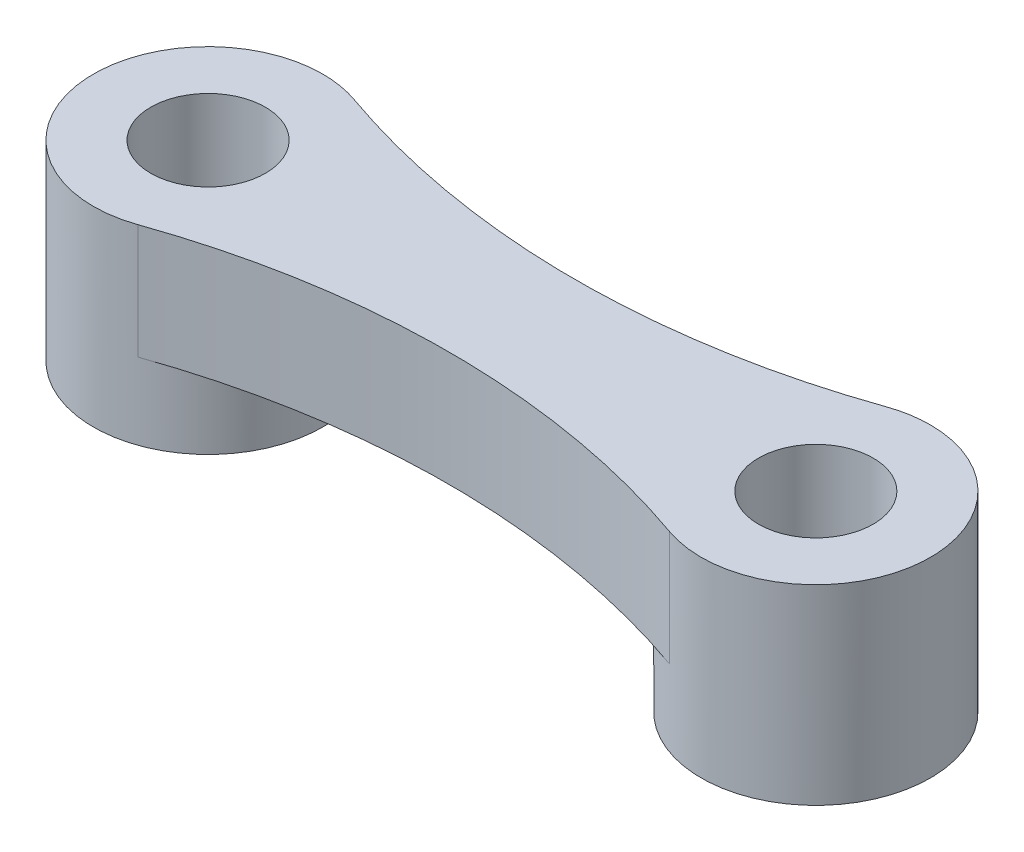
ISO-10303-21;
HEADER;
FILE_DESCRIPTION(('STEP AP214'),'2;1');
FILE_NAME('part.step','',(''),(''),'','','');
FILE_SCHEMA(('AUTOMOTIVE_DESIGN { 1 0 10303 214 1 1 1 1 }'));
ENDSEC;
DATA;
#1=APPLICATION_CONTEXT('core data for automotive mechanical design processes');
#2=APPLICATION_PROTOCOL_DEFINITION('international standard','automotive_design',2000,#1);
#3=PRODUCT_CONTEXT('',#1,'mechanical');
#4=PRODUCT('Part','Part','',(#3));
#5=PRODUCT_RELATED_PRODUCT_CATEGORY('part','',(#4));
#6=PRODUCT_DEFINITION_FORMATION('','',#4);
#7=PRODUCT_DEFINITION_CONTEXT('part definition',#1,'design');
#8=PRODUCT_DEFINITION('design','',#6,#7);
#9=PRODUCT_DEFINITION_SHAPE('','',#8);
#10=(LENGTH_UNIT() NAMED_UNIT(*) SI_UNIT(.MILLI.,.METRE.));
#11=(NAMED_UNIT(*) PLANE_ANGLE_UNIT() SI_UNIT($,.RADIAN.));
#12=(NAMED_UNIT(*) SI_UNIT($,.STERADIAN.) SOLID_ANGLE_UNIT());
#13=UNCERTAINTY_MEASURE_WITH_UNIT(LENGTH_MEASURE(1.E-05),#10,'distance_accuracy_value','');
#14=(GEOMETRIC_REPRESENTATION_CONTEXT(3) GLOBAL_UNCERTAINTY_ASSIGNED_CONTEXT((#13)) GLOBAL_UNIT_ASSIGNED_CONTEXT((#10,
#11,#12)) REPRESENTATION_CONTEXT('',''));
#15=CARTESIAN_POINT('',(0.,0.,0.));
#16=DIRECTION('',(0.,0.,1.));
#17=DIRECTION('',(1.,0.,0.));
#18=AXIS2_PLACEMENT_3D('',#15,#16,#17);
#19=CARTESIAN_POINT('',(-3.97499999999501,0.,-11.3225162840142));
#20=DIRECTION('',(0.,-1.,0.));
#21=DIRECTION('',(0.,0.,-1.));
#22=AXIS2_PLACEMENT_3D('',#19,#20,#21);
#23=PLANE('',#22);
#24=CARTESIAN_POINT('',(0.,0.,22.645032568));
#25=DIRECTION('',(0.,1.,0.));
#26=DIRECTION('',(0.,0.,1.));
#27=AXIS2_PLACEMENT_3D('',#24,#25,#26);
#28=CIRCLE('',#27,21.0000000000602);
#29=CARTESIAN_POINT('',(6.95624999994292,0.,2.83062907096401));
#30=VERTEX_POINT('',#29);
#31=CARTESIAN_POINT('',(-6.95624999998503,0.,2.83062907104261));
#32=VERTEX_POINT('',#31);
#33=EDGE_CURVE('E79',#30,#32,#28,.T.);
#34=ORIENTED_EDGE('',*,*,#33,.T.);
#35=CARTESIAN_POINT('',(-7.95,0.,0.));
#36=DIRECTION('',(0.,-1.,0.));
#37=DIRECTION('',(0.,0.,-1.));
#38=AXIS2_PLACEMENT_3D('',#35,#36,#37);
#39=CIRCLE('',#38,3.);
#40=CARTESIAN_POINT('',(-6.95625000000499,0.,-2.8306290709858));
#41=VERTEX_POINT('',#40);
#42=EDGE_CURVE('E119',#41,#32,#39,.T.);
#43=ORIENTED_EDGE('',*,*,#42,.F.);
#44=CARTESIAN_POINT('',(9.97812943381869E-12,0.,-22.6450325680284));
#45=DIRECTION('',(0.,1.,0.));
#46=DIRECTION('',(0.,0.,1.));
#47=AXIS2_PLACEMENT_3D('',#44,#45,#46);
#48=CIRCLE('',#47,21.0000000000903);
#49=CARTESIAN_POINT('',(6.95624999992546,0.,-2.83062907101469));
#50=VERTEX_POINT('',#49);
#51=EDGE_CURVE('E109',#41,#50,#48,.T.);
#52=ORIENTED_EDGE('',*,*,#51,.T.);
#53=CARTESIAN_POINT('',(7.95,0.,0.));
#54=DIRECTION('',(0.,-1.,0.));
#55=DIRECTION('',(0.,0.,-1.));
#56=AXIS2_PLACEMENT_3D('',#53,#54,#55);
#57=CIRCLE('',#56,3.);
#58=EDGE_CURVE('E93',#30,#50,#57,.T.);
#59=ORIENTED_EDGE('',*,*,#58,.F.);
#60=EDGE_LOOP('',(#34,#43,#52,#59));
#61=FACE_BOUND('',#60,.T.);
#62=ADVANCED_FACE('F41',(#61),#23,.T.);
#63=CARTESIAN_POINT('',(-7.95,3.,0.));
#64=DIRECTION('',(0.,-1.,0.));
#65=DIRECTION('',(0.,0.,-1.));
#66=AXIS2_PLACEMENT_3D('',#63,#64,#65);
#67=CYLINDRICAL_SURFACE('',#66,3.00000000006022);
#68=DIRECTION('',(0.,-1.,0.));
#69=VECTOR('',#68,1.);
#70=CARTESIAN_POINT('',(-6.95624999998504,3.,-2.83062907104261));
#71=LINE('',#70,#69);
#72=CARTESIAN_POINT('',(-6.95624999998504,3.,-2.83062907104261));
#73=VERTEX_POINT('',#72);
#74=EDGE_CURVE('E45',#73,#41,#71,.T.);
#75=ORIENTED_EDGE('',*,*,#74,.T.);
#76=ORIENTED_EDGE('',*,*,#42,.T.);
#77=DIRECTION('',(0.,-1.,0.));
#78=VECTOR('',#77,1.);
#79=CARTESIAN_POINT('',(-6.95624999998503,3.,2.83062907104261));
#80=LINE('',#79,#78);
#81=CARTESIAN_POINT('',(-6.95624999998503,3.,2.83062907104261));
#82=VERTEX_POINT('',#81);
#83=EDGE_CURVE('E11',#82,#32,#80,.T.);
#84=ORIENTED_EDGE('',*,*,#83,.F.);
#85=CARTESIAN_POINT('',(-7.95,3.,0.));
#86=DIRECTION('',(0.,-1.,0.));
#87=DIRECTION('',(0.,0.,-1.));
#88=AXIS2_PLACEMENT_3D('',#85,#86,#87);
#89=CIRCLE('',#88,3.00000000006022);
#90=EDGE_CURVE('E103',#82,#73,#89,.T.);
#91=ORIENTED_EDGE('',*,*,#90,.T.);
#92=EDGE_LOOP('',(#75,#76,#84,#91));
#93=FACE_BOUND('',#92,.T.);
#94=CARTESIAN_POINT('',(-7.95,-2.,0.));
#95=DIRECTION('',(0.,-1.,0.));
#96=DIRECTION('',(0.,0.,-1.));
#97=AXIS2_PLACEMENT_3D('',#94,#95,#96);
#98=CIRCLE('',#97,3.);
#99=CARTESIAN_POINT('',(-7.95,-2.,-3.));
#100=VERTEX_POINT('',#99);
#101=EDGE_CURVE('E115',#100,#100,#98,.T.);
#102=ORIENTED_EDGE('',*,*,#101,.F.);
#103=EDGE_LOOP('',(#102));
#104=FACE_BOUND('',#103,.T.);
#105=ADVANCED_FACE('F43',(#93,#104),#67,.T.);
#106=CARTESIAN_POINT('',(0.,3.,22.645032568));
#107=DIRECTION('',(0.,-1.,0.));
#108=DIRECTION('',(0.,0.,-1.));
#109=AXIS2_PLACEMENT_3D('',#106,#107,#108);
#110=CYLINDRICAL_SURFACE('',#109,21.0000000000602);
#111=ORIENTED_EDGE('',*,*,#33,.F.);
#112=DIRECTION('',(0.,-1.,0.));
#113=VECTOR('',#112,1.);
#114=CARTESIAN_POINT('',(6.95624999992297,3.,2.83062907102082));
#115=LINE('',#114,#113);
#116=CARTESIAN_POINT('',(6.95624999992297,3.,2.83062907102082));
#117=VERTEX_POINT('',#116);
#118=EDGE_CURVE('E51',#117,#30,#115,.T.);
#119=ORIENTED_EDGE('',*,*,#118,.F.);
#120=CARTESIAN_POINT('',(0.,3.,22.645032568));
#121=DIRECTION('',(0.,1.,0.));
#122=DIRECTION('',(0.,0.,1.));
#123=AXIS2_PLACEMENT_3D('',#120,#121,#122);
#124=CIRCLE('',#123,21.0000000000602);
#125=EDGE_CURVE('E99',#117,#82,#124,.T.);
#126=ORIENTED_EDGE('',*,*,#125,.T.);
#127=ORIENTED_EDGE('',*,*,#83,.T.);
#128=EDGE_LOOP('',(#111,#119,#126,#127));
#129=FACE_BOUND('',#128,.T.);
#130=ADVANCED_FACE('F164',(#129),#110,.F.);
#131=CARTESIAN_POINT('',(7.94999999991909,3.,3.50267000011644E-12));
#132=DIRECTION('',(0.,-1.,0.));
#133=DIRECTION('',(0.,0.,-1.));
#134=AXIS2_PLACEMENT_3D('',#131,#132,#133);
#135=CYLINDRICAL_SURFACE('',#134,3.00000000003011);
#136=ORIENTED_EDGE('',*,*,#118,.T.);
#137=ORIENTED_EDGE('',*,*,#58,.T.);
#138=DIRECTION('',(0.,-1.,0.));
#139=VECTOR('',#138,1.);
#140=CARTESIAN_POINT('',(6.95624999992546,3.,-2.83062907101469));
#141=LINE('',#140,#139);
#142=CARTESIAN_POINT('',(6.95624999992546,3.,-2.83062907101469));
#143=VERTEX_POINT('',#142);
#144=EDGE_CURVE('E71',#143,#50,#141,.T.);
#145=ORIENTED_EDGE('',*,*,#144,.F.);
#146=CARTESIAN_POINT('',(7.94999999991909,3.,3.50267000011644E-12));
#147=DIRECTION('',(0.,-1.,0.));
#148=DIRECTION('',(0.,0.,-1.));
#149=AXIS2_PLACEMENT_3D('',#146,#147,#148);
#150=CIRCLE('',#149,3.00000000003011);
#151=EDGE_CURVE('E90',#143,#117,#150,.T.);
#152=ORIENTED_EDGE('',*,*,#151,.T.);
#153=EDGE_LOOP('',(#136,#137,#145,#152));
#154=FACE_BOUND('',#153,.T.);
#155=CARTESIAN_POINT('',(7.95,-2.,0.));
#156=DIRECTION('',(0.,-1.,0.));
#157=DIRECTION('',(0.,0.,-1.));
#158=AXIS2_PLACEMENT_3D('',#155,#156,#157);
#159=CIRCLE('',#158,3.);
#160=CARTESIAN_POINT('',(7.95,-2.,-3.));
#161=VERTEX_POINT('',#160);
#162=EDGE_CURVE('E111',#161,#161,#159,.T.);
#163=ORIENTED_EDGE('',*,*,#162,.F.);
#164=EDGE_LOOP('',(#163));
#165=FACE_BOUND('',#164,.T.);
#166=ADVANCED_FACE('F88',(#154,#165),#135,.T.);
#167=CARTESIAN_POINT('',(9.97812943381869E-12,3.,-22.6450325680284));
#168=DIRECTION('',(0.,-1.,0.));
#169=DIRECTION('',(0.,0.,-1.));
#170=AXIS2_PLACEMENT_3D('',#167,#168,#169);
#171=CYLINDRICAL_SURFACE('',#170,21.0000000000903);
#172=ORIENTED_EDGE('',*,*,#51,.F.);
#173=ORIENTED_EDGE('',*,*,#74,.F.);
#174=CARTESIAN_POINT('',(9.97812943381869E-12,3.,-22.6450325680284));
#175=DIRECTION('',(0.,1.,0.));
#176=DIRECTION('',(0.,0.,1.));
#177=AXIS2_PLACEMENT_3D('',#174,#175,#176);
#178=CIRCLE('',#177,21.0000000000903);
#179=EDGE_CURVE('E97',#73,#143,#178,.T.);
#180=ORIENTED_EDGE('',*,*,#179,.T.);
#181=ORIENTED_EDGE('',*,*,#144,.T.);
#182=EDGE_LOOP('',(#172,#173,#180,#181));
#183=FACE_BOUND('',#182,.T.);
#184=ADVANCED_FACE('F101',(#183),#171,.F.);
#185=CARTESIAN_POINT('',(-3.97499999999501,3.,-11.3225162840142));
#186=DIRECTION('',(0.,-1.,0.));
#187=DIRECTION('',(0.,0.,-1.));
#188=AXIS2_PLACEMENT_3D('',#185,#186,#187);
#189=PLANE('',#188);
#190=CARTESIAN_POINT('',(-7.95,3.,0.));
#191=DIRECTION('',(0.,1.,0.));
#192=DIRECTION('',(0.,0.,1.));
#193=AXIS2_PLACEMENT_3D('',#190,#191,#192);
#194=CIRCLE('',#193,1.49999999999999);
#195=CARTESIAN_POINT('',(-7.95,3.,1.49999999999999));
#196=VERTEX_POINT('',#195);
#197=EDGE_CURVE('E132',#196,#196,#194,.T.);
#198=ORIENTED_EDGE('',*,*,#197,.F.);
#199=EDGE_LOOP('',(#198));
#200=FACE_BOUND('',#199,.T.);
#201=CARTESIAN_POINT('',(7.95,3.,0.));
#202=DIRECTION('',(0.,1.,0.));
#203=DIRECTION('',(0.,0.,1.));
#204=AXIS2_PLACEMENT_3D('',#201,#202,#203);
#205=CIRCLE('',#204,1.49999999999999);
#206=CARTESIAN_POINT('',(7.95,3.,1.49999999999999));
#207=VERTEX_POINT('',#206);
#208=EDGE_CURVE('E126',#207,#207,#205,.T.);
#209=ORIENTED_EDGE('',*,*,#208,.F.);
#210=EDGE_LOOP('',(#209));
#211=FACE_BOUND('',#210,.T.);
#212=ORIENTED_EDGE('',*,*,#90,.F.);
#213=ORIENTED_EDGE('',*,*,#125,.F.);
#214=ORIENTED_EDGE('',*,*,#151,.F.);
#215=ORIENTED_EDGE('',*,*,#179,.F.);
#216=EDGE_LOOP('',(#212,#213,#214,#215));
#217=FACE_BOUND('',#216,.T.);
#218=ADVANCED_FACE('F96',(#200,#211,#217),#189,.F.);
#219=CARTESIAN_POINT('',(7.95,-2.,0.));
#220=DIRECTION('',(0.,-1.,0.));
#221=DIRECTION('',(0.,0.,-1.));
#222=AXIS2_PLACEMENT_3D('',#219,#220,#221);
#223=PLANE('',#222);
#224=CARTESIAN_POINT('',(7.95,-2.,0.));
#225=DIRECTION('',(0.,1.,0.));
#226=DIRECTION('',(0.,0.,1.));
#227=AXIS2_PLACEMENT_3D('',#224,#225,#226);
#228=CIRCLE('',#227,1.49999999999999);
#229=CARTESIAN_POINT('',(7.95,-2.,1.49999999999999));
#230=VERTEX_POINT('',#229);
#231=EDGE_CURVE('E122',#230,#230,#228,.T.);
#232=ORIENTED_EDGE('',*,*,#231,.T.);
#233=EDGE_LOOP('',(#232));
#234=FACE_BOUND('',#233,.T.);
#235=ORIENTED_EDGE('',*,*,#162,.T.);
#236=EDGE_LOOP('',(#235));
#237=FACE_BOUND('',#236,.T.);
#238=ADVANCED_FACE('F140',(#234,#237),#223,.T.);
#239=CARTESIAN_POINT('',(-7.95,-2.,0.));
#240=DIRECTION('',(0.,-1.,0.));
#241=DIRECTION('',(0.,0.,-1.));
#242=AXIS2_PLACEMENT_3D('',#239,#240,#241);
#243=PLANE('',#242);
#244=CARTESIAN_POINT('',(-7.95,-2.,0.));
#245=DIRECTION('',(0.,1.,0.));
#246=DIRECTION('',(0.,0.,1.));
#247=AXIS2_PLACEMENT_3D('',#244,#245,#246);
#248=CIRCLE('',#247,1.49999999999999);
#249=CARTESIAN_POINT('',(-7.95,-2.,1.49999999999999));
#250=VERTEX_POINT('',#249);
#251=EDGE_CURVE('E129',#250,#250,#248,.T.);
#252=ORIENTED_EDGE('',*,*,#251,.T.);
#253=EDGE_LOOP('',(#252));
#254=FACE_BOUND('',#253,.T.);
#255=ORIENTED_EDGE('',*,*,#101,.T.);
#256=EDGE_LOOP('',(#255));
#257=FACE_BOUND('',#256,.T.);
#258=ADVANCED_FACE('F146',(#254,#257),#243,.T.);
#259=CARTESIAN_POINT('',(7.95,3.,0.));
#260=DIRECTION('',(0.,1.,0.));
#261=DIRECTION('',(0.,0.,1.));
#262=AXIS2_PLACEMENT_3D('',#259,#260,#261);
#263=CYLINDRICAL_SURFACE('',#262,1.49999999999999);
#264=ORIENTED_EDGE('',*,*,#231,.F.);
#265=EDGE_LOOP('',(#264));
#266=FACE_BOUND('',#265,.T.);
#267=ORIENTED_EDGE('',*,*,#208,.T.);
#268=EDGE_LOOP('',(#267));
#269=FACE_BOUND('',#268,.T.);
#270=ADVANCED_FACE('F144',(#266,#269),#263,.F.);
#271=CARTESIAN_POINT('',(-7.95,3.,0.));
#272=DIRECTION('',(0.,1.,0.));
#273=DIRECTION('',(0.,0.,1.));
#274=AXIS2_PLACEMENT_3D('',#271,#272,#273);
#275=CYLINDRICAL_SURFACE('',#274,1.49999999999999);
#276=ORIENTED_EDGE('',*,*,#251,.F.);
#277=EDGE_LOOP('',(#276));
#278=FACE_BOUND('',#277,.T.);
#279=ORIENTED_EDGE('',*,*,#197,.T.);
#280=EDGE_LOOP('',(#279));
#281=FACE_BOUND('',#280,.T.);
#282=ADVANCED_FACE('F136',(#278,#281),#275,.F.);
#283=CLOSED_SHELL('',(#62,#105,#130,#166,#184,#218,#238,#258,#270,#282));
#284=MANIFOLD_SOLID_BREP('B2',#283);
#285=ADVANCED_BREP_SHAPE_REPRESENTATION('',(#18,#284),#14);
#286=SHAPE_DEFINITION_REPRESENTATION(#9,#285);
ENDSEC;
END-ISO-10303-21;
